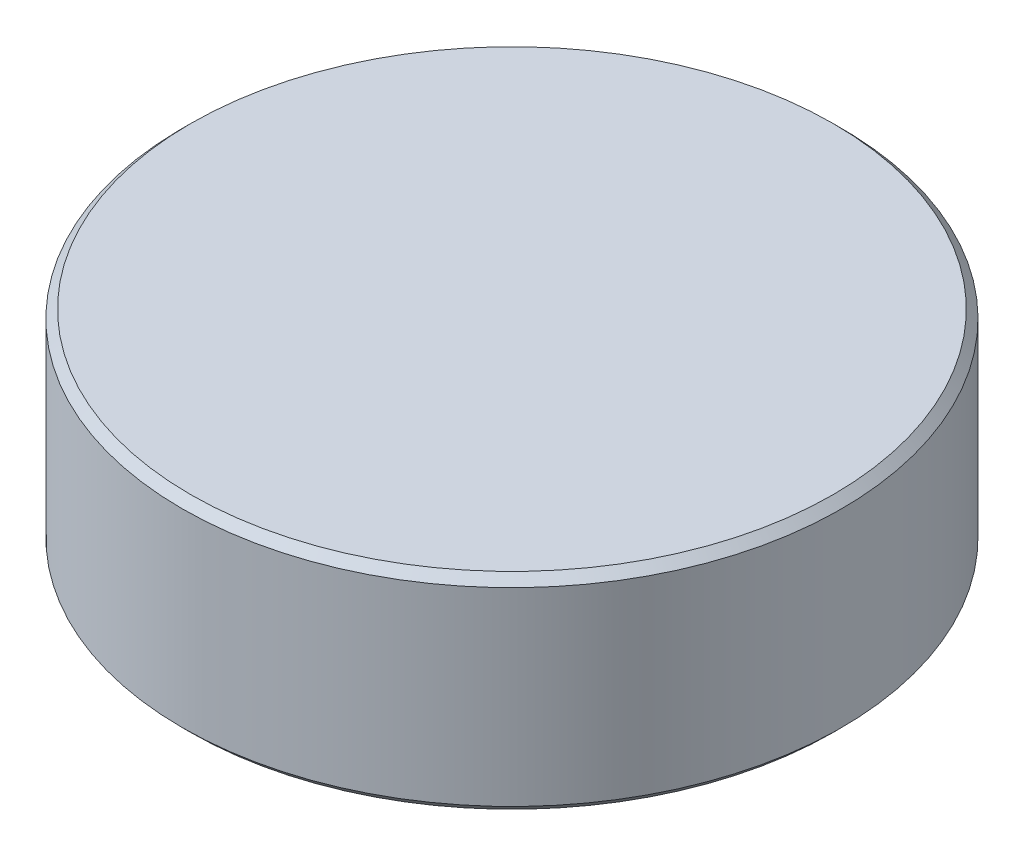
ISO-10303-21;
HEADER;
FILE_DESCRIPTION(('STEP AP214'),'2;1');
FILE_NAME('part.step','',(''),(''),'','','');
FILE_SCHEMA(('AUTOMOTIVE_DESIGN { 1 0 10303 214 1 1 1 1 }'));
ENDSEC;
DATA;
#1=APPLICATION_CONTEXT('core data for automotive mechanical design processes');
#2=APPLICATION_PROTOCOL_DEFINITION('international standard','automotive_design',2000,#1);
#3=PRODUCT_CONTEXT('',#1,'mechanical');
#4=PRODUCT('Part','Part','',(#3));
#5=PRODUCT_RELATED_PRODUCT_CATEGORY('part','',(#4));
#6=PRODUCT_DEFINITION_FORMATION('','',#4);
#7=PRODUCT_DEFINITION_CONTEXT('part definition',#1,'design');
#8=PRODUCT_DEFINITION('design','',#6,#7);
#9=PRODUCT_DEFINITION_SHAPE('','',#8);
#10=(LENGTH_UNIT() NAMED_UNIT(*) SI_UNIT(.MILLI.,.METRE.));
#11=(NAMED_UNIT(*) PLANE_ANGLE_UNIT() SI_UNIT($,.RADIAN.));
#12=(NAMED_UNIT(*) SI_UNIT($,.STERADIAN.) SOLID_ANGLE_UNIT());
#13=UNCERTAINTY_MEASURE_WITH_UNIT(LENGTH_MEASURE(1.E-05),#10,'distance_accuracy_value','');
#14=(GEOMETRIC_REPRESENTATION_CONTEXT(3) GLOBAL_UNCERTAINTY_ASSIGNED_CONTEXT((#13)) GLOBAL_UNIT_ASSIGNED_CONTEXT((#10,
#11,#12)) REPRESENTATION_CONTEXT('',''));
#15=CARTESIAN_POINT('',(0.,0.,0.));
#16=DIRECTION('',(0.,0.,1.));
#17=DIRECTION('',(1.,0.,0.));
#18=AXIS2_PLACEMENT_3D('',#15,#16,#17);
#19=CARTESIAN_POINT('',(0.,31.75,0.));
#20=DIRECTION('',(0.,-1.,0.));
#21=DIRECTION('',(0.,0.,-1.));
#22=AXIS2_PLACEMENT_3D('',#19,#20,#21);
#23=CYLINDRICAL_SURFACE('',#22,50.8);
#24=CARTESIAN_POINT('',(0.,1.26999999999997,0.));
#25=DIRECTION('',(0.,1.,0.));
#26=DIRECTION('',(0.,0.,1.));
#27=AXIS2_PLACEMENT_3D('',#24,#25,#26);
#28=CIRCLE('',#27,50.8);
#29=CARTESIAN_POINT('',(0.,1.26999999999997,50.8));
#30=VERTEX_POINT('',#29);
#31=EDGE_CURVE('E48',#30,#30,#28,.T.);
#32=ORIENTED_EDGE('',*,*,#31,.T.);
#33=EDGE_LOOP('',(#32));
#34=FACE_BOUND('',#33,.T.);
#35=CARTESIAN_POINT('',(0.,30.48,0.));
#36=DIRECTION('',(0.,1.,0.));
#37=DIRECTION('',(0.,0.,1.));
#38=AXIS2_PLACEMENT_3D('',#35,#36,#37);
#39=CIRCLE('',#38,50.8);
#40=CARTESIAN_POINT('',(0.,30.48,50.8));
#41=VERTEX_POINT('',#40);
#42=EDGE_CURVE('E52',#41,#41,#39,.F.);
#43=ORIENTED_EDGE('',*,*,#42,.T.);
#44=EDGE_LOOP('',(#43));
#45=FACE_BOUND('',#44,.T.);
#46=ADVANCED_FACE('F37',(#34,#45),#23,.T.);
#47=CARTESIAN_POINT('',(0.,31.75,0.));
#48=DIRECTION('',(0.,1.,0.));
#49=DIRECTION('',(0.,0.,1.));
#50=AXIS2_PLACEMENT_3D('',#47,#48,#49);
#51=PLANE('',#50);
#52=CARTESIAN_POINT('',(0.,31.75,0.));
#53=DIRECTION('',(0.,1.,0.));
#54=DIRECTION('',(0.,0.,1.));
#55=AXIS2_PLACEMENT_3D('',#52,#53,#54);
#56=CIRCLE('',#55,49.53);
#57=CARTESIAN_POINT('',(0.,31.75,49.53));
#58=VERTEX_POINT('',#57);
#59=EDGE_CURVE('E10',#58,#58,#56,.T.);
#60=ORIENTED_EDGE('',*,*,#59,.T.);
#61=EDGE_LOOP('',(#60));
#62=FACE_BOUND('',#61,.T.);
#63=ADVANCED_FACE('F68',(#62),#51,.T.);
#64=CARTESIAN_POINT('',(0.,0.,0.));
#65=DIRECTION('',(0.,1.,0.));
#66=DIRECTION('',(0.,0.,1.));
#67=AXIS2_PLACEMENT_3D('',#64,#65,#66);
#68=PLANE('',#67);
#69=CARTESIAN_POINT('',(0.,0.,0.));
#70=DIRECTION('',(0.,1.,0.));
#71=DIRECTION('',(0.,0.,1.));
#72=AXIS2_PLACEMENT_3D('',#69,#70,#71);
#73=CIRCLE('',#72,49.53);
#74=CARTESIAN_POINT('',(0.,0.,49.53));
#75=VERTEX_POINT('',#74);
#76=EDGE_CURVE('E44',#75,#75,#73,.F.);
#77=ORIENTED_EDGE('',*,*,#76,.T.);
#78=EDGE_LOOP('',(#77));
#79=FACE_BOUND('',#78,.T.);
#80=ADVANCED_FACE('F65',(#79),#68,.F.);
#81=CARTESIAN_POINT('',(0.,1.26999999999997,0.));
#82=DIRECTION('',(0.,1.,0.));
#83=DIRECTION('',(0.,0.,1.));
#84=AXIS2_PLACEMENT_3D('',#81,#82,#83);
#85=CONICAL_SURFACE('',#84,50.8,0.785398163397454);
#86=ORIENTED_EDGE('',*,*,#76,.F.);
#87=EDGE_LOOP('',(#86));
#88=FACE_BOUND('',#87,.T.);
#89=ORIENTED_EDGE('',*,*,#31,.F.);
#90=EDGE_LOOP('',(#89));
#91=FACE_BOUND('',#90,.T.);
#92=ADVANCED_FACE('F61',(#88,#91),#85,.T.);
#93=CARTESIAN_POINT('',(0.,31.75,0.));
#94=DIRECTION('',(0.,-1.,0.));
#95=DIRECTION('',(0.,0.,-1.));
#96=AXIS2_PLACEMENT_3D('',#93,#94,#95);
#97=CONICAL_SURFACE('',#96,49.53,0.785398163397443);
#98=ORIENTED_EDGE('',*,*,#42,.F.);
#99=EDGE_LOOP('',(#98));
#100=FACE_BOUND('',#99,.T.);
#101=ORIENTED_EDGE('',*,*,#59,.F.);
#102=EDGE_LOOP('',(#101));
#103=FACE_BOUND('',#102,.T.);
#104=ADVANCED_FACE('F39',(#100,#103),#97,.T.);
#105=CLOSED_SHELL('',(#46,#63,#80,#92,#104));
#106=MANIFOLD_SOLID_BREP('B2',#105);
#107=ADVANCED_BREP_SHAPE_REPRESENTATION('',(#18,#106),#14);
#108=SHAPE_DEFINITION_REPRESENTATION(#9,#107);
ENDSEC;
END-ISO-10303-21;
